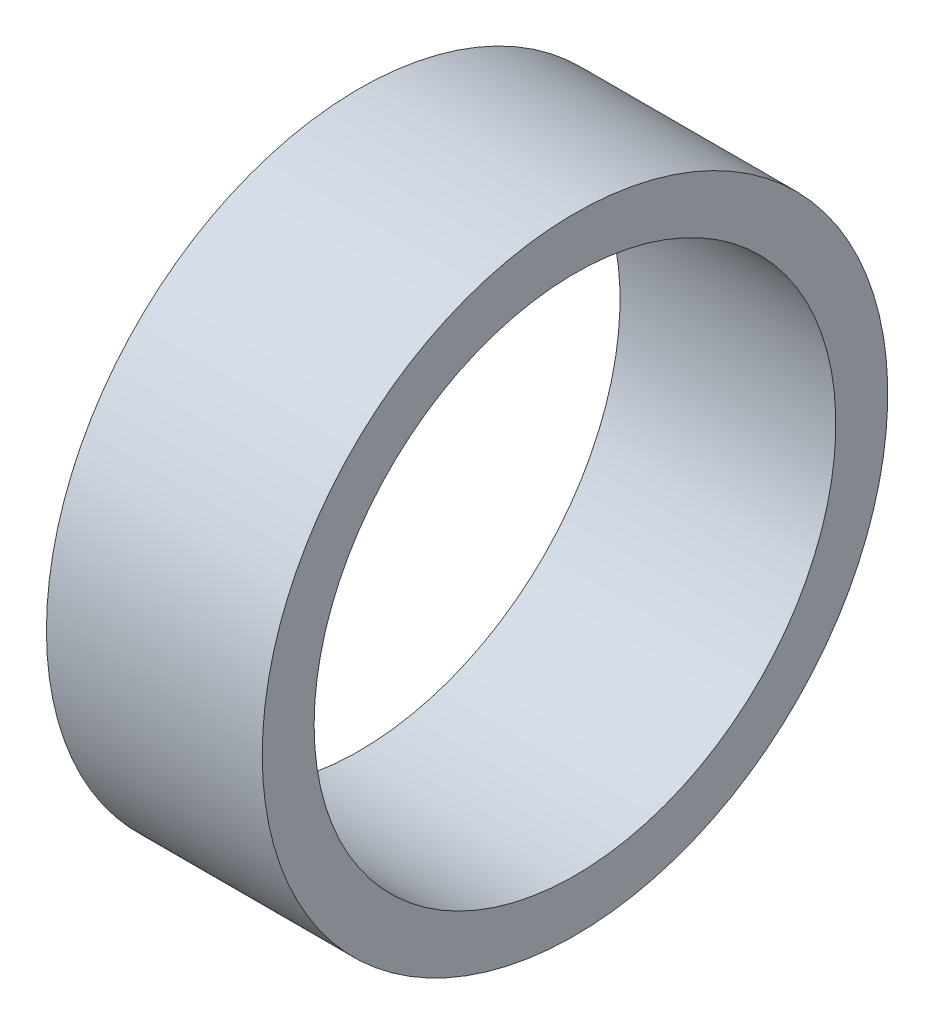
ISO-10303-21;
HEADER;
FILE_DESCRIPTION(('STEP AP214'),'2;1');
FILE_NAME('part.step','',(''),(''),'','','');
FILE_SCHEMA(('AUTOMOTIVE_DESIGN { 1 0 10303 214 1 1 1 1 }'));
ENDSEC;
DATA;
#1=APPLICATION_CONTEXT('core data for automotive mechanical design processes');
#2=APPLICATION_PROTOCOL_DEFINITION('international standard','automotive_design',2000,#1);
#3=PRODUCT_CONTEXT('',#1,'mechanical');
#4=PRODUCT('Part','Part','',(#3));
#5=PRODUCT_RELATED_PRODUCT_CATEGORY('part','',(#4));
#6=PRODUCT_DEFINITION_FORMATION('','',#4);
#7=PRODUCT_DEFINITION_CONTEXT('part definition',#1,'design');
#8=PRODUCT_DEFINITION('design','',#6,#7);
#9=PRODUCT_DEFINITION_SHAPE('','',#8);
#10=(LENGTH_UNIT() NAMED_UNIT(*) SI_UNIT(.MILLI.,.METRE.));
#11=(NAMED_UNIT(*) PLANE_ANGLE_UNIT() SI_UNIT($,.RADIAN.));
#12=(NAMED_UNIT(*) SI_UNIT($,.STERADIAN.) SOLID_ANGLE_UNIT());
#13=UNCERTAINTY_MEASURE_WITH_UNIT(LENGTH_MEASURE(1.E-05),#10,'distance_accuracy_value','');
#14=(GEOMETRIC_REPRESENTATION_CONTEXT(3) GLOBAL_UNCERTAINTY_ASSIGNED_CONTEXT((#13)) GLOBAL_UNIT_ASSIGNED_CONTEXT((#10,
#11,#12)) REPRESENTATION_CONTEXT('',''));
#15=CARTESIAN_POINT('',(0.,0.,0.));
#16=DIRECTION('',(0.,0.,1.));
#17=DIRECTION('',(1.,0.,0.));
#18=AXIS2_PLACEMENT_3D('',#15,#16,#17);
#19=CARTESIAN_POINT('',(3.95,11.45,0.));
#20=DIRECTION('',(-1.,0.,0.));
#21=DIRECTION('',(0.,0.,1.));
#22=AXIS2_PLACEMENT_3D('',#19,#20,#21);
#23=PLANE('',#22);
#24=CARTESIAN_POINT('',(3.95,0.,0.));
#25=DIRECTION('',(-1.,0.,0.));
#26=DIRECTION('',(0.,0.,1.));
#27=AXIS2_PLACEMENT_3D('',#24,#25,#26);
#28=CIRCLE('',#27,11.45);
#29=CARTESIAN_POINT('',(3.95,0.,11.45));
#30=VERTEX_POINT('',#29);
#31=EDGE_CURVE('E10',#30,#30,#28,.T.);
#32=ORIENTED_EDGE('',*,*,#31,.F.);
#33=EDGE_LOOP('',(#32));
#34=FACE_BOUND('',#33,.T.);
#35=CARTESIAN_POINT('',(3.95,0.,0.));
#36=DIRECTION('',(-1.,0.,0.));
#37=DIRECTION('',(0.,0.,1.));
#38=AXIS2_PLACEMENT_3D('',#35,#36,#37);
#39=CIRCLE('',#38,9.55);
#40=CARTESIAN_POINT('',(3.95,0.,9.55));
#41=VERTEX_POINT('',#40);
#42=EDGE_CURVE('E30',#41,#41,#39,.T.);
#43=ORIENTED_EDGE('',*,*,#42,.T.);
#44=EDGE_LOOP('',(#43));
#45=FACE_BOUND('',#44,.T.);
#46=ADVANCED_FACE('F16',(#34,#45),#23,.F.);
#47=CARTESIAN_POINT('',(0.,0.,0.));
#48=DIRECTION('',(-1.,0.,0.));
#49=DIRECTION('',(0.,0.,1.));
#50=AXIS2_PLACEMENT_3D('',#47,#48,#49);
#51=CYLINDRICAL_SURFACE('',#50,11.45);
#52=CARTESIAN_POINT('',(-3.95,0.,0.));
#53=DIRECTION('',(-1.,0.,0.));
#54=DIRECTION('',(0.,0.,1.));
#55=AXIS2_PLACEMENT_3D('',#52,#53,#54);
#56=CIRCLE('',#55,11.45);
#57=CARTESIAN_POINT('',(-3.95,0.,11.45));
#58=VERTEX_POINT('',#57);
#59=EDGE_CURVE('E22',#58,#58,#56,.T.);
#60=ORIENTED_EDGE('',*,*,#59,.F.);
#61=EDGE_LOOP('',(#60));
#62=FACE_BOUND('',#61,.T.);
#63=ORIENTED_EDGE('',*,*,#31,.T.);
#64=EDGE_LOOP('',(#63));
#65=FACE_BOUND('',#64,.T.);
#66=ADVANCED_FACE('F45',(#62,#65),#51,.T.);
#67=CARTESIAN_POINT('',(-3.95,11.45,0.));
#68=DIRECTION('',(1.,0.,0.));
#69=DIRECTION('',(0.,0.,-1.));
#70=AXIS2_PLACEMENT_3D('',#67,#68,#69);
#71=PLANE('',#70);
#72=CARTESIAN_POINT('',(-3.95,0.,0.));
#73=DIRECTION('',(-1.,0.,0.));
#74=DIRECTION('',(0.,0.,1.));
#75=AXIS2_PLACEMENT_3D('',#72,#73,#74);
#76=CIRCLE('',#75,9.55);
#77=CARTESIAN_POINT('',(-3.95,0.,9.55));
#78=VERTEX_POINT('',#77);
#79=EDGE_CURVE('E26',#78,#78,#76,.T.);
#80=ORIENTED_EDGE('',*,*,#79,.F.);
#81=EDGE_LOOP('',(#80));
#82=FACE_BOUND('',#81,.T.);
#83=ORIENTED_EDGE('',*,*,#59,.T.);
#84=EDGE_LOOP('',(#83));
#85=FACE_BOUND('',#84,.T.);
#86=ADVANCED_FACE('F40',(#82,#85),#71,.F.);
#87=CARTESIAN_POINT('',(0.,0.,0.));
#88=DIRECTION('',(-1.,0.,0.));
#89=DIRECTION('',(0.,0.,1.));
#90=AXIS2_PLACEMENT_3D('',#87,#88,#89);
#91=CYLINDRICAL_SURFACE('',#90,9.55);
#92=ORIENTED_EDGE('',*,*,#42,.F.);
#93=EDGE_LOOP('',(#92));
#94=FACE_BOUND('',#93,.T.);
#95=ORIENTED_EDGE('',*,*,#79,.T.);
#96=EDGE_LOOP('',(#95));
#97=FACE_BOUND('',#96,.T.);
#98=ADVANCED_FACE('F37',(#94,#97),#91,.F.);
#99=CLOSED_SHELL('',(#46,#66,#86,#98));
#100=MANIFOLD_SOLID_BREP('B1',#99);
#101=ADVANCED_BREP_SHAPE_REPRESENTATION('',(#18,#100),#14);
#102=SHAPE_DEFINITION_REPRESENTATION(#9,#101);
ENDSEC;
END-ISO-10303-21;
